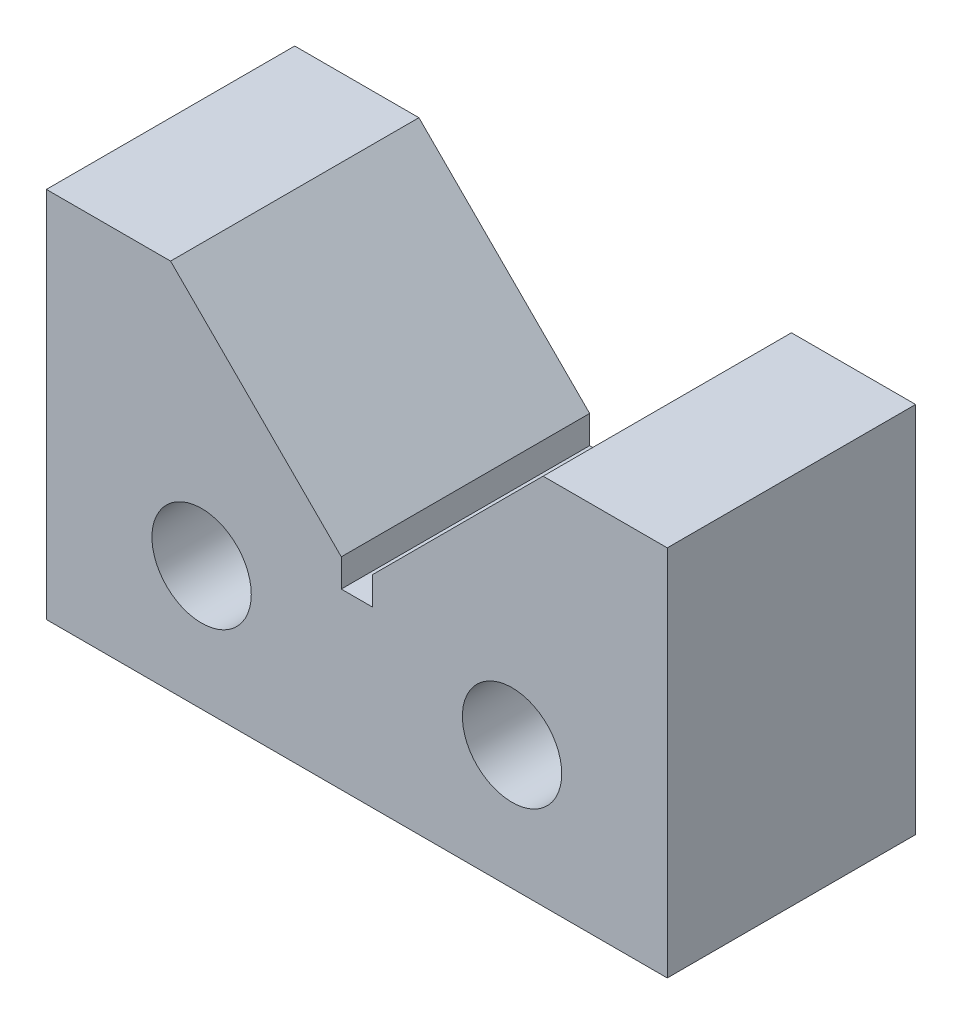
from build123d import *

# Parameters (mm, degrees)
SKETCH_1_W          = 100
SKETCH_1_H          = 60
EXTRUDE_1_DEPTH     = 40
CUT_EXTRUDE_1_DEPTH = 88.749643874
SKETCH_4_W          = 5
SKETCH_4_H          = 4.5
CUT_EXTRUDE_2_DEPTH = 88.749643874
SKETCH_5_R          = 8
CUT_EXTRUDE_3_DEPTH = 88.749643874


with BuildPart() as part:
    # Sketch 1 → Extrude 1 (new body)
    with BuildSketch(Plane.XY):
        with Locations((0, 30)):
            Rectangle(SKETCH_1_W, SKETCH_1_H)
    extrude(amount=EXTRUDE_1_DEPTH)

    # Sketch 3 → Cut-Extrude 1 (cut, through all)
    with BuildSketch(Plane.XY.offset(40)):
        Polygon((30, 60), (-30, 60), (0, 30), align=None)
    extrude(amount=-CUT_EXTRUDE_1_DEPTH, mode=Mode.SUBTRACT)

    # Sketch 4 → Cut-Extrude 2 (cut, through all)
    with BuildSketch(Plane.XY.offset(40)):
        with Locations((0, 30.25)):
            Rectangle(SKETCH_4_W, SKETCH_4_H)
    extrude(amount=-CUT_EXTRUDE_2_DEPTH, mode=Mode.SUBTRACT)

    # Sketch 5 → Cut-Extrude 3 (cut, through all)
    with BuildSketch(Plane.XY.offset(40)):
        with Locations((-25, 20)):
            Circle(SKETCH_5_R)
        with Locations((25, 20)):
            Circle(SKETCH_5_R)
    extrude(amount=-CUT_EXTRUDE_3_DEPTH, mode=Mode.SUBTRACT)


solid = part.part
